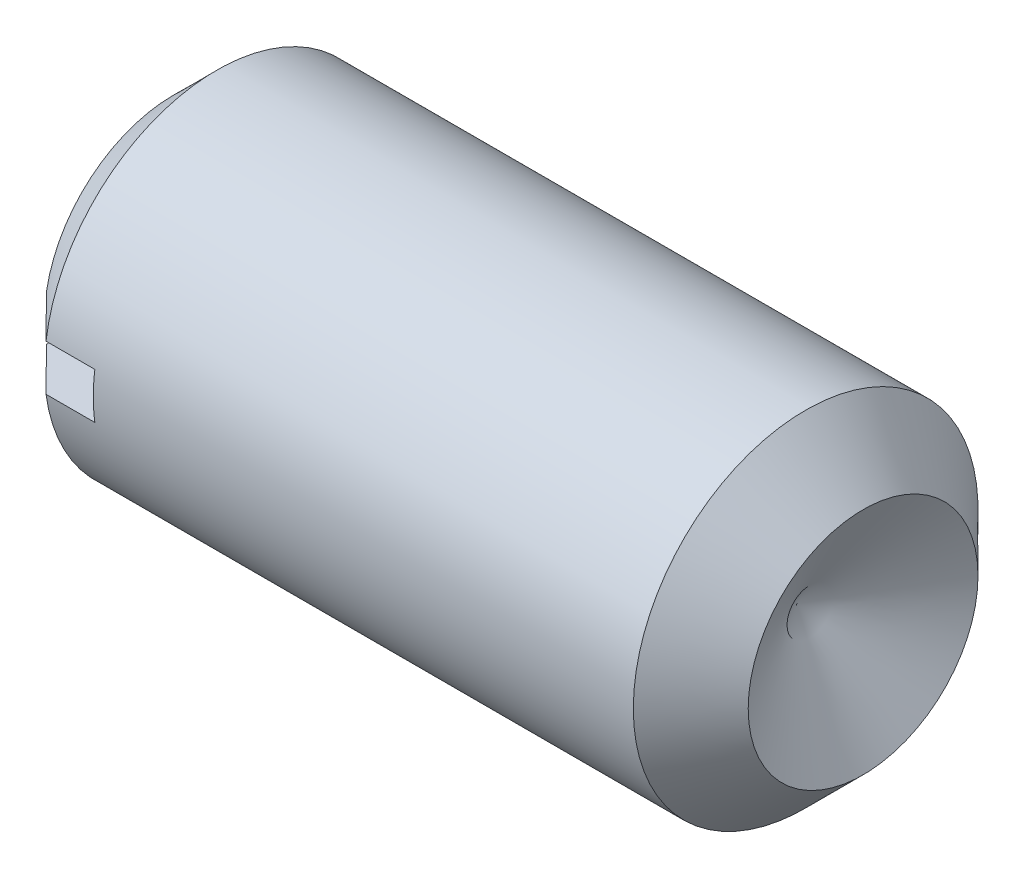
ISO-10303-21;
HEADER;
FILE_DESCRIPTION(('STEP AP214'),'2;1');
FILE_NAME('part.step','',(''),(''),'','','');
FILE_SCHEMA(('AUTOMOTIVE_DESIGN { 1 0 10303 214 1 1 1 1 }'));
ENDSEC;
DATA;
#1=APPLICATION_CONTEXT('core data for automotive mechanical design processes');
#2=APPLICATION_PROTOCOL_DEFINITION('international standard','automotive_design',2000,#1);
#3=PRODUCT_CONTEXT('',#1,'mechanical');
#4=PRODUCT('Part','Part','',(#3));
#5=PRODUCT_RELATED_PRODUCT_CATEGORY('part','',(#4));
#6=PRODUCT_DEFINITION_FORMATION('','',#4);
#7=PRODUCT_DEFINITION_CONTEXT('part definition',#1,'design');
#8=PRODUCT_DEFINITION('design','',#6,#7);
#9=PRODUCT_DEFINITION_SHAPE('','',#8);
#10=(LENGTH_UNIT() NAMED_UNIT(*) SI_UNIT(.MILLI.,.METRE.));
#11=(NAMED_UNIT(*) PLANE_ANGLE_UNIT() SI_UNIT($,.RADIAN.));
#12=(NAMED_UNIT(*) SI_UNIT($,.STERADIAN.) SOLID_ANGLE_UNIT());
#13=UNCERTAINTY_MEASURE_WITH_UNIT(LENGTH_MEASURE(1.E-05),#10,'distance_accuracy_value','');
#14=(GEOMETRIC_REPRESENTATION_CONTEXT(3) GLOBAL_UNCERTAINTY_ASSIGNED_CONTEXT((#13)) GLOBAL_UNIT_ASSIGNED_CONTEXT((#10,
#11,#12)) REPRESENTATION_CONTEXT('',''));
#15=CARTESIAN_POINT('',(0.,0.,0.));
#16=DIRECTION('',(0.,0.,1.));
#17=DIRECTION('',(1.,0.,0.));
#18=AXIS2_PLACEMENT_3D('',#15,#16,#17);
#19=CARTESIAN_POINT('',(0.,1.125,0.));
#20=DIRECTION('',(1.,0.,0.));
#21=DIRECTION('',(0.,0.,-1.));
#22=AXIS2_PLACEMENT_3D('',#19,#20,#21);
#23=PLANE('',#22);
#24=CARTESIAN_POINT('',(0.,0.,0.));
#25=DIRECTION('',(-1.,0.,0.));
#26=DIRECTION('',(0.,0.,1.));
#27=AXIS2_PLACEMENT_3D('',#24,#25,#26);
#28=CIRCLE('',#27,1.125);
#29=CARTESIAN_POINT('',(0.,0.2,1.10707949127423));
#30=VERTEX_POINT('',#29);
#31=CARTESIAN_POINT('',(0.,0.2,-1.10707949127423));
#32=VERTEX_POINT('',#31);
#33=EDGE_CURVE('E126',#30,#32,#28,.T.);
#34=ORIENTED_EDGE('',*,*,#33,.T.);
#35=DIRECTION('',(0.,0.,1.));
#36=VECTOR('',#35,1.);
#37=CARTESIAN_POINT('',(0.,0.2,-1.5));
#38=LINE('',#37,#36);
#39=EDGE_CURVE('E112',#32,#30,#38,.T.);
#40=ORIENTED_EDGE('',*,*,#39,.T.);
#41=EDGE_LOOP('',(#34,#40));
#42=FACE_BOUND('',#41,.T.);
#43=ADVANCED_FACE('F43',(#42),#23,.F.);
#44=CARTESIAN_POINT('',(0.375000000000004,0.,0.));
#45=DIRECTION('',(1.,0.,0.));
#46=DIRECTION('',(0.,0.,-1.));
#47=AXIS2_PLACEMENT_3D('',#44,#45,#46);
#48=CONICAL_SURFACE('',#47,1.5,0.785398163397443);
#49=CARTESIAN_POINT('',(0.375000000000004,0.,0.));
#50=DIRECTION('',(-1.,0.,0.));
#51=DIRECTION('',(0.,0.,1.));
#52=AXIS2_PLACEMENT_3D('',#49,#50,#51);
#53=CIRCLE('',#52,1.5);
#54=CARTESIAN_POINT('',(0.375000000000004,0.2,1.48660687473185));
#55=VERTEX_POINT('',#54);
#56=CARTESIAN_POINT('',(0.375000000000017,0.2,-1.48660687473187));
#57=VERTEX_POINT('',#56);
#58=EDGE_CURVE('E135',#55,#57,#53,.T.);
#59=ORIENTED_EDGE('',*,*,#58,.T.);
#60=CARTESIAN_POINT('',(2.18920799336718,0.2,-3.30816786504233));
#61=CARTESIAN_POINT('',(2.07649366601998,0.2,-3.19524610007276));
#62=CARTESIAN_POINT('',(1.96378832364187,0.2,-3.08231535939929));
#63=CARTESIAN_POINT('',(1.73840550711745,0.2,-2.85642283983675));
#64=CARTESIAN_POINT('',(1.6257280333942,0.2,-2.74346106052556));
#65=CARTESIAN_POINT('',(1.40037767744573,0.2,-2.51746010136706));
#66=CARTESIAN_POINT('',(1.28770480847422,0.2,-2.40442090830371));
#67=CARTESIAN_POINT('',(1.06242244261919,0.2,-2.17828252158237));
#68=CARTESIAN_POINT('',(0.949812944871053,0.2,-2.06518332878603));
#69=CARTESIAN_POINT('',(0.72157858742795,0.2,-1.83575394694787));
#70=CARTESIAN_POINT('',(0.605956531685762,0.2,-1.71942096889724));
#71=CARTESIAN_POINT('',(0.374890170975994,0.2,-1.48656880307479));
#72=CARTESIAN_POINT('',(0.259445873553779,0.2,-1.3700496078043));
#73=CARTESIAN_POINT('',(0.0865825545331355,0.2,-1.19499523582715));
#74=CARTESIAN_POINT('',(0.0290178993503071,0.2,-1.13660389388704));
#75=CARTESIAN_POINT('',(-0.0859582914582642,0.2,-1.01966845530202));
#76=CARTESIAN_POINT('',(-0.143369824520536,0.2,-0.961124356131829));
#77=CARTESIAN_POINT('',(-0.257927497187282,0.2,-0.843786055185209));
#78=CARTESIAN_POINT('',(-0.315073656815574,0.2,-0.784991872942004));
#79=CARTESIAN_POINT('',(-0.428894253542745,0.2,-0.666949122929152));
#80=CARTESIAN_POINT('',(-0.485568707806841,0.2,-0.607700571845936));
#81=CARTESIAN_POINT('',(-0.556834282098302,0.2,-0.531827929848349));
#82=CARTESIAN_POINT('',(-0.571929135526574,0.2,-0.515678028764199));
#83=CARTESIAN_POINT('',(-0.602008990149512,0.2,-0.483276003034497));
#84=CARTESIAN_POINT('',(-0.616993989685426,0.2,-0.467023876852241));
#85=CARTESIAN_POINT('',(-0.661668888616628,0.2,-0.418156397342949));
#86=CARTESIAN_POINT('',(-0.691153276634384,0.2,-0.385351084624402));
#87=CARTESIAN_POINT('',(-0.738520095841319,0.2,-0.330870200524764));
#88=CARTESIAN_POINT('',(-0.756726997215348,0.2,-0.309479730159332));
#89=CARTESIAN_POINT('',(-0.792449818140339,0.2,-0.26597934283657));
#90=CARTESIAN_POINT('',(-0.809962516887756,0.2,-0.243866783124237));
#91=CARTESIAN_POINT('',(-0.8437679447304,0.2,-0.198329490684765));
#92=CARTESIAN_POINT('',(-0.860046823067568,0.2,-0.174893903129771));
#93=CARTESIAN_POINT('',(-0.882018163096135,0.2,-0.13831631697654));
#94=CARTESIAN_POINT('',(-0.888920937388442,0.2,-0.125916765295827));
#95=CARTESIAN_POINT('',(-0.901444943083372,0.2,-0.100497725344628));
#96=CARTESIAN_POINT('',(-0.907068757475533,0.2,-0.0874795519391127));
#97=CARTESIAN_POINT('',(-0.916365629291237,0.2,-0.0607035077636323));
#98=CARTESIAN_POINT('',(-0.920035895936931,0.2,-0.046944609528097));
#99=CARTESIAN_POINT('',(-0.924561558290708,0.2,-0.019019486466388));
#100=CARTESIAN_POINT('',(-0.925434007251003,0.2,-0.00485626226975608));
#101=CARTESIAN_POINT('',(-0.924139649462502,0.2,0.0233294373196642));
#102=CARTESIAN_POINT('',(-0.921970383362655,0.2,0.0373517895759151));
#103=CARTESIAN_POINT('',(-0.915181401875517,0.2,0.064842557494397));
#104=CARTESIAN_POINT('',(-0.910545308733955,0.2,0.0783066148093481));
#105=CARTESIAN_POINT('',(-0.898239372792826,0.2,0.107921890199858));
#106=CARTESIAN_POINT('',(-0.890094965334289,0.2,0.123867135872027));
#107=CARTESIAN_POINT('',(-0.872331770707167,0.2,0.154929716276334));
#108=CARTESIAN_POINT('',(-0.862709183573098,0.2,0.170044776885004));
#109=CARTESIAN_POINT('',(-0.842523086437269,0.2,0.199782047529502));
#110=CARTESIAN_POINT('',(-0.831953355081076,0.2,0.214399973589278));
#111=CARTESIAN_POINT('',(-0.810271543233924,0.2,0.24319218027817));
#112=CARTESIAN_POINT('',(-0.79916020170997,0.2,0.257367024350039));
#113=CARTESIAN_POINT('',(-0.761648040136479,0.2,0.303984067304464));
#114=CARTESIAN_POINT('',(-0.734462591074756,0.2,0.335790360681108));
#115=CARTESIAN_POINT('',(-0.679232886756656,0.2,0.398651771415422));
#116=CARTESIAN_POINT('',(-0.651188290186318,0.2,0.429706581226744));
#117=CARTESIAN_POINT('',(-0.594583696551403,0.2,0.491419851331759));
#118=CARTESIAN_POINT('',(-0.566023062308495,0.2,0.522077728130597));
#119=CARTESIAN_POINT('',(-0.508622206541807,0.2,0.583118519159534));
#120=CARTESIAN_POINT('',(-0.479782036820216,0.2,0.613501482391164));
#121=CARTESIAN_POINT('',(-0.393361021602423,0.2,0.704003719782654));
#122=CARTESIAN_POINT('',(-0.335513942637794,0.2,0.763868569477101));
#123=CARTESIAN_POINT('',(-0.219518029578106,0.2,0.883224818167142));
#124=CARTESIAN_POINT('',(-0.161369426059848,0.2,0.942716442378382));
#125=CARTESIAN_POINT('',(-0.00876825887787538,0.2,1.09833366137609));
#126=CARTESIAN_POINT('',(0.08584162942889,0.2,1.19430497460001));
#127=CARTESIAN_POINT('',(0.27529800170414,0.2,1.38601480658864));
#128=CARTESIAN_POINT('',(0.370144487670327,0.2,1.48175332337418));
#129=CARTESIAN_POINT('',(0.654937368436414,0.2,1.76883520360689));
#130=CARTESIAN_POINT('',(0.845078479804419,0.2,1.95998539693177));
#131=CARTESIAN_POINT('',(1.22752139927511,0.2,2.34406726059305));
#132=CARTESIAN_POINT('',(1.41982522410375,0.2,2.53699691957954));
#133=CARTESIAN_POINT('',(1.80448365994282,0.2,2.92267869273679));
#134=CARTESIAN_POINT('',(1.99683823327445,0.2,3.11543084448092));
#135=CARTESIAN_POINT('',(2.18920799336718,0.2,3.30816786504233));
#136=B_SPLINE_CURVE_WITH_KNOTS('',3,(#60,#61,#62,#63,#64,#65,#66,#67,#68,#69,#70,#71,#72,#73,
#74,#75,#76,#77,#78,#79,#80,#81,#82,#83,#84,#85,#86,#87,#88,#89,#90,#91,#92,#93,#94,#95,#96,#97,
#98,#99,#100,#101,#102,#103,#104,#105,#106,#107,#108,#109,#110,#111,#112,#113,#114,#115,#116,
#117,#118,#119,#120,#121,#122,#123,#124,#125,#126,#127,#128,#129,#130,#131,#132,#133,#134,#135),
.UNSPECIFIED.,.F.,.F.,(4,2,2,2,2,2,2,2,2,2,2,2,2,2,2,2,2,2,2,2,2,2,2,2,2,2,2,2,2,2,2,2,2,2,2,2,
2,4),(0.,0.478646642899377,0.957300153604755,1.43610836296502,1.91490987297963,2.40696308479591,
2.89903663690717,3.14502260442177,3.39101266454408,3.63698385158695,3.88294604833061,
3.94926343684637,4.01558182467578,4.14789298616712,4.23214940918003,4.31675946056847,
4.40221020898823,4.444739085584,4.48718129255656,4.52968396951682,4.57192708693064,
4.61420437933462,4.6567659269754,4.71033863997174,4.76405145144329,4.81814735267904,
4.87217140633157,4.99764955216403,5.12317821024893,5.24887419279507,5.37454731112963,
5.62428482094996,5.87385340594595,6.27814619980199,6.68244241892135,7.49128561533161,
8.30849034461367,9.12542549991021),.UNSPECIFIED.);
#137=EDGE_CURVE('E189',#57,#32,#136,.T.);
#138=ORIENTED_EDGE('',*,*,#137,.T.);
#139=ORIENTED_EDGE('',*,*,#33,.F.);
#140=EDGE_CURVE('E146',#30,#55,#136,.T.);
#141=ORIENTED_EDGE('',*,*,#140,.T.);
#142=EDGE_LOOP('',(#59,#138,#139,#141));
#143=FACE_BOUND('',#142,.T.);
#144=ADVANCED_FACE('F170',(#143),#48,.T.);
#145=CARTESIAN_POINT('',(0.,-0.2,-1.10707949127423));
#146=VERTEX_POINT('',#145);
#147=CARTESIAN_POINT('',(0.,-0.2,1.10707949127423));
#148=VERTEX_POINT('',#147);
#149=EDGE_CURVE('E129',#146,#148,#28,.T.);
#150=ORIENTED_EDGE('',*,*,#149,.T.);
#151=DIRECTION('',(0.,0.,1.));
#152=VECTOR('',#151,1.);
#153=CARTESIAN_POINT('',(0.,-0.2,-1.5));
#154=LINE('',#153,#152);
#155=EDGE_CURVE('E110',#146,#148,#154,.T.);
#156=ORIENTED_EDGE('',*,*,#155,.F.);
#157=EDGE_LOOP('',(#150,#156));
#158=FACE_BOUND('',#157,.T.);
#159=ADVANCED_FACE('F44',(#158),#23,.F.);
#160=CARTESIAN_POINT('',(5.42264973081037,0.,0.));
#161=DIRECTION('',(1.,0.,0.));
#162=DIRECTION('',(0.,0.,-1.));
#163=AXIS2_PLACEMENT_3D('',#160,#161,#162);
#164=CONICAL_SURFACE('',#163,0.,1.04719755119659);
#165=CARTESIAN_POINT('',(6.,0.,0.));
#166=DIRECTION('',(-1.,0.,0.));
#167=DIRECTION('',(0.,0.,1.));
#168=AXIS2_PLACEMENT_3D('',#165,#166,#167);
#169=CIRCLE('',#168,1.);
#170=CARTESIAN_POINT('',(6.,0.,1.));
#171=VERTEX_POINT('',#170);
#172=EDGE_CURVE('E136',#171,#171,#169,.T.);
#173=ORIENTED_EDGE('',*,*,#172,.F.);
#174=EDGE_LOOP('',(#173));
#175=FACE_BOUND('',#174,.T.);
#176=CARTESIAN_POINT('',(5.42264973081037,0.,0.));
#177=VERTEX_POINT('',#176);
#178=VERTEX_LOOP('',#177);
#179=FACE_BOUND('',#178,.T.);
#180=ADVANCED_FACE('F172',(#175,#179),#164,.F.);
#181=CARTESIAN_POINT('',(6.,0.,0.));
#182=DIRECTION('',(-1.,0.,0.));
#183=DIRECTION('',(0.,0.,1.));
#184=AXIS2_PLACEMENT_3D('',#181,#182,#183);
#185=CONICAL_SURFACE('',#184,1.,0.785398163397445);
#186=CARTESIAN_POINT('',(5.5,0.,0.));
#187=DIRECTION('',(-1.,0.,0.));
#188=DIRECTION('',(0.,0.,1.));
#189=AXIS2_PLACEMENT_3D('',#186,#187,#188);
#190=CIRCLE('',#189,1.5);
#191=CARTESIAN_POINT('',(5.5,0.,1.5));
#192=VERTEX_POINT('',#191);
#193=EDGE_CURVE('E133',#192,#192,#190,.T.);
#194=ORIENTED_EDGE('',*,*,#193,.F.);
#195=EDGE_LOOP('',(#194));
#196=FACE_BOUND('',#195,.T.);
#197=ORIENTED_EDGE('',*,*,#172,.T.);
#198=EDGE_LOOP('',(#197));
#199=FACE_BOUND('',#198,.T.);
#200=ADVANCED_FACE('F179',(#196,#199),#185,.T.);
#201=CARTESIAN_POINT('',(-10.7450145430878,0.,0.));
#202=DIRECTION('',(-1.,0.,0.));
#203=DIRECTION('',(0.,0.,1.));
#204=AXIS2_PLACEMENT_3D('',#201,#202,#203);
#205=CYLINDRICAL_SURFACE('',#204,1.5);
#206=CARTESIAN_POINT('',(0.8,0.,0.));
#207=DIRECTION('',(1.,0.,0.));
#208=DIRECTION('',(0.,0.,-1.));
#209=AXIS2_PLACEMENT_3D('',#206,#207,#208);
#210=CIRCLE('',#209,1.5);
#211=CARTESIAN_POINT('',(0.8,-0.2,-1.48660687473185));
#212=VERTEX_POINT('',#211);
#213=CARTESIAN_POINT('',(0.8,0.2,-1.48660687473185));
#214=VERTEX_POINT('',#213);
#215=EDGE_CURVE('E11',#212,#214,#210,.T.);
#216=ORIENTED_EDGE('',*,*,#215,.T.);
#217=DIRECTION('',(-1.,0.,0.));
#218=VECTOR('',#217,1.);
#219=CARTESIAN_POINT('',(-10.7450145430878,0.2,-1.48660687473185));
#220=LINE('',#219,#218);
#221=EDGE_CURVE('E121',#214,#57,#220,.T.);
#222=ORIENTED_EDGE('',*,*,#221,.T.);
#223=ORIENTED_EDGE('',*,*,#58,.F.);
#224=DIRECTION('',(-1.,0.,0.));
#225=VECTOR('',#224,1.);
#226=CARTESIAN_POINT('',(-10.7450145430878,0.2,1.48660687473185));
#227=LINE('',#226,#225);
#228=CARTESIAN_POINT('',(0.8,0.2,1.48660687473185));
#229=VERTEX_POINT('',#228);
#230=EDGE_CURVE('E116',#55,#229,#227,.F.);
#231=ORIENTED_EDGE('',*,*,#230,.T.);
#232=CARTESIAN_POINT('',(0.8,-0.2,1.48660687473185));
#233=VERTEX_POINT('',#232);
#234=EDGE_CURVE('E50',#229,#233,#210,.T.);
#235=ORIENTED_EDGE('',*,*,#234,.T.);
#236=DIRECTION('',(-1.,0.,0.));
#237=VECTOR('',#236,1.);
#238=CARTESIAN_POINT('',(-10.7450145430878,-0.2,1.48660687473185));
#239=LINE('',#238,#237);
#240=CARTESIAN_POINT('',(0.375000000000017,-0.2,1.48660687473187));
#241=VERTEX_POINT('',#240);
#242=EDGE_CURVE('E106',#233,#241,#239,.T.);
#243=ORIENTED_EDGE('',*,*,#242,.T.);
#244=CARTESIAN_POINT('',(0.375000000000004,-0.2,-1.48660687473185));
#245=VERTEX_POINT('',#244);
#246=EDGE_CURVE('E113',#245,#241,#53,.T.);
#247=ORIENTED_EDGE('',*,*,#246,.F.);
#248=DIRECTION('',(-1.,0.,0.));
#249=VECTOR('',#248,1.);
#250=CARTESIAN_POINT('',(-10.7450145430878,-0.2,-1.48660687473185));
#251=LINE('',#250,#249);
#252=EDGE_CURVE('E59',#245,#212,#251,.F.);
#253=ORIENTED_EDGE('',*,*,#252,.T.);
#254=EDGE_LOOP('',(#216,#222,#223,#231,#235,#243,#247,#253));
#255=FACE_BOUND('',#254,.T.);
#256=ORIENTED_EDGE('',*,*,#193,.T.);
#257=EDGE_LOOP('',(#256));
#258=FACE_BOUND('',#257,.T.);
#259=ADVANCED_FACE('F109',(#255,#258),#205,.T.);
#260=ORIENTED_EDGE('',*,*,#246,.T.);
#261=CARTESIAN_POINT('',(2.18920799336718,-0.2,3.30816786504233));
#262=CARTESIAN_POINT('',(2.07649366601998,-0.2,3.19524610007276));
#263=CARTESIAN_POINT('',(1.96378832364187,-0.2,3.08231535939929));
#264=CARTESIAN_POINT('',(1.73840550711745,-0.2,2.85642283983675));
#265=CARTESIAN_POINT('',(1.6257280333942,-0.2,2.74346106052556));
#266=CARTESIAN_POINT('',(1.40037767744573,-0.2,2.51746010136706));
#267=CARTESIAN_POINT('',(1.28770480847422,-0.2,2.40442090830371));
#268=CARTESIAN_POINT('',(1.06242244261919,-0.2,2.17828252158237));
#269=CARTESIAN_POINT('',(0.949812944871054,-0.2,2.06518332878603));
#270=CARTESIAN_POINT('',(0.721578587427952,-0.2,1.83575394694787));
#271=CARTESIAN_POINT('',(0.605956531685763,-0.2,1.71942096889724));
#272=CARTESIAN_POINT('',(0.374890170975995,-0.2,1.48656880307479));
#273=CARTESIAN_POINT('',(0.25944587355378,-0.2,1.3700496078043));
#274=CARTESIAN_POINT('',(0.0865825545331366,-0.2,1.19499523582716));
#275=CARTESIAN_POINT('',(0.0290178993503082,-0.2,1.13660389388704));
#276=CARTESIAN_POINT('',(-0.0859582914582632,-0.2,1.01966845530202));
#277=CARTESIAN_POINT('',(-0.143369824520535,-0.2,0.96112435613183));
#278=CARTESIAN_POINT('',(-0.257927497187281,-0.2,0.843786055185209));
#279=CARTESIAN_POINT('',(-0.315073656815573,-0.2,0.784991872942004));
#280=CARTESIAN_POINT('',(-0.428894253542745,-0.2,0.666949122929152));
#281=CARTESIAN_POINT('',(-0.485568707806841,-0.2,0.607700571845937));
#282=CARTESIAN_POINT('',(-0.556834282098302,-0.2,0.53182792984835));
#283=CARTESIAN_POINT('',(-0.571929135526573,-0.2,0.515678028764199));
#284=CARTESIAN_POINT('',(-0.602008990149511,-0.2,0.483276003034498));
#285=CARTESIAN_POINT('',(-0.616993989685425,-0.2,0.467023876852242));
#286=CARTESIAN_POINT('',(-0.661668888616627,-0.2,0.418156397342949));
#287=CARTESIAN_POINT('',(-0.691153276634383,-0.2,0.385351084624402));
#288=CARTESIAN_POINT('',(-0.738520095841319,-0.2,0.330870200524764));
#289=CARTESIAN_POINT('',(-0.756726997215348,-0.2,0.309479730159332));
#290=CARTESIAN_POINT('',(-0.792449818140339,-0.2,0.26597934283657));
#291=CARTESIAN_POINT('',(-0.809962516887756,-0.2,0.243866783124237));
#292=CARTESIAN_POINT('',(-0.8437679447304,-0.2,0.198329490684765));
#293=CARTESIAN_POINT('',(-0.860046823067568,-0.2,0.174893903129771));
#294=CARTESIAN_POINT('',(-0.882018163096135,-0.2,0.138316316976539));
#295=CARTESIAN_POINT('',(-0.888920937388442,-0.2,0.125916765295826));
#296=CARTESIAN_POINT('',(-0.901444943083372,-0.2,0.100497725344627));
#297=CARTESIAN_POINT('',(-0.907068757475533,-0.2,0.0874795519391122));
#298=CARTESIAN_POINT('',(-0.916365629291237,-0.2,0.0607035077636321));
#299=CARTESIAN_POINT('',(-0.920035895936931,-0.2,0.0469446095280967));
#300=CARTESIAN_POINT('',(-0.924561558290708,-0.2,0.0190194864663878));
#301=CARTESIAN_POINT('',(-0.925434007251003,-0.2,0.00485626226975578));
#302=CARTESIAN_POINT('',(-0.924139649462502,-0.2,-0.0233294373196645));
#303=CARTESIAN_POINT('',(-0.921970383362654,-0.2,-0.0373517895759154));
#304=CARTESIAN_POINT('',(-0.915181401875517,-0.2,-0.0648425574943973));
#305=CARTESIAN_POINT('',(-0.910545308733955,-0.2,-0.0783066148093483));
#306=CARTESIAN_POINT('',(-0.898239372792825,-0.2,-0.107921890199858));
#307=CARTESIAN_POINT('',(-0.890094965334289,-0.2,-0.123867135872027));
#308=CARTESIAN_POINT('',(-0.872331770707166,-0.2,-0.154929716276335));
#309=CARTESIAN_POINT('',(-0.862709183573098,-0.2,-0.170044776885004));
#310=CARTESIAN_POINT('',(-0.842523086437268,-0.2,-0.199782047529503));
#311=CARTESIAN_POINT('',(-0.831953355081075,-0.2,-0.214399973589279));
#312=CARTESIAN_POINT('',(-0.810271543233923,-0.2,-0.243192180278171));
#313=CARTESIAN_POINT('',(-0.799160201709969,-0.2,-0.25736702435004));
#314=CARTESIAN_POINT('',(-0.761648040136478,-0.2,-0.303984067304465));
#315=CARTESIAN_POINT('',(-0.734462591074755,-0.2,-0.335790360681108));
#316=CARTESIAN_POINT('',(-0.679232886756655,-0.2,-0.398651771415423));
#317=CARTESIAN_POINT('',(-0.651188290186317,-0.2,-0.429706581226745));
#318=CARTESIAN_POINT('',(-0.594583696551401,-0.2,-0.491419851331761));
#319=CARTESIAN_POINT('',(-0.566023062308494,-0.2,-0.522077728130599));
#320=CARTESIAN_POINT('',(-0.508622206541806,-0.2,-0.583118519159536));
#321=CARTESIAN_POINT('',(-0.479782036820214,-0.2,-0.613501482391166));
#322=CARTESIAN_POINT('',(-0.39336102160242,-0.2,-0.704003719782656));
#323=CARTESIAN_POINT('',(-0.335513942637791,-0.2,-0.763868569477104));
#324=CARTESIAN_POINT('',(-0.219518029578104,-0.2,-0.883224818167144));
#325=CARTESIAN_POINT('',(-0.161369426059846,-0.2,-0.942716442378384));
#326=CARTESIAN_POINT('',(-0.00876825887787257,-0.2,-1.0983336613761));
#327=CARTESIAN_POINT('',(0.0858416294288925,-0.2,-1.19430497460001));
#328=CARTESIAN_POINT('',(0.275298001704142,-0.2,-1.38601480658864));
#329=CARTESIAN_POINT('',(0.37014448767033,-0.2,-1.48175332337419));
#330=CARTESIAN_POINT('',(0.654937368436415,-0.2,-1.76883520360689));
#331=CARTESIAN_POINT('',(0.84507847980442,-0.2,-1.95998539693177));
#332=CARTESIAN_POINT('',(1.22752139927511,-0.2,-2.34406726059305));
#333=CARTESIAN_POINT('',(1.41982522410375,-0.2,-2.53699691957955));
#334=CARTESIAN_POINT('',(1.80448365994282,-0.2,-2.92267869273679));
#335=CARTESIAN_POINT('',(1.99683823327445,-0.2,-3.11543084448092));
#336=CARTESIAN_POINT('',(2.18920799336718,-0.2,-3.30816786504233));
#337=B_SPLINE_CURVE_WITH_KNOTS('',3,(#261,#262,#263,#264,#265,#266,#267,#268,#269,#270,#271,
#272,#273,#274,#275,#276,#277,#278,#279,#280,#281,#282,#283,#284,#285,#286,#287,#288,#289,#290,
#291,#292,#293,#294,#295,#296,#297,#298,#299,#300,#301,#302,#303,#304,#305,#306,#307,#308,#309,
#310,#311,#312,#313,#314,#315,#316,#317,#318,#319,#320,#321,#322,#323,#324,#325,#326,#327,#328,
#329,#330,#331,#332,#333,#334,#335,#336),.UNSPECIFIED.,.F.,.F.,(4,2,2,2,2,2,2,2,2,2,2,2,2,2,2,2,
2,2,2,2,2,2,2,2,2,2,2,2,2,2,2,2,2,2,2,2,2,4),(0.,0.478646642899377,0.957300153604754,
1.43610836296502,1.91490987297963,2.40696308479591,2.89903663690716,3.14502260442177,
3.39101266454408,3.63698385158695,3.88294604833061,3.94926343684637,4.01558182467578,
4.14789298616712,4.23214940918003,4.31675946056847,4.40221020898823,4.444739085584,
4.48718129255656,4.52968396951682,4.57192708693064,4.61420437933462,4.6567659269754,
4.71033863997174,4.76405145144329,4.81814735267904,4.87217140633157,4.99764955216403,
5.12317821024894,5.24887419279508,5.37454731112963,5.62428482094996,5.87385340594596,
6.278146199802,6.68244241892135,7.49128561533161,8.30849034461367,9.12542549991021),.UNSPECIFIED.);
#338=EDGE_CURVE('E149',#241,#148,#337,.T.);
#339=ORIENTED_EDGE('',*,*,#338,.T.);
#340=ORIENTED_EDGE('',*,*,#149,.F.);
#341=EDGE_CURVE('E137',#146,#245,#337,.T.);
#342=ORIENTED_EDGE('',*,*,#341,.T.);
#343=EDGE_LOOP('',(#260,#339,#340,#342));
#344=FACE_BOUND('',#343,.T.);
#345=ADVANCED_FACE('F153',(#344),#48,.T.);
#346=CARTESIAN_POINT('',(0.8,0.2,-1.5));
#347=DIRECTION('',(1.,0.,0.));
#348=DIRECTION('',(0.,0.,-1.));
#349=AXIS2_PLACEMENT_3D('',#346,#347,#348);
#350=PLANE('',#349);
#351=DIRECTION('',(0.,0.,1.));
#352=VECTOR('',#351,1.);
#353=CARTESIAN_POINT('',(0.8,0.2,-1.5));
#354=LINE('',#353,#352);
#355=EDGE_CURVE('E99',#214,#229,#354,.T.);
#356=ORIENTED_EDGE('',*,*,#355,.F.);
#357=ORIENTED_EDGE('',*,*,#215,.F.);
#358=DIRECTION('',(0.,0.,1.));
#359=VECTOR('',#358,1.);
#360=CARTESIAN_POINT('',(0.8,-0.2,-1.5));
#361=LINE('',#360,#359);
#362=EDGE_CURVE('E97',#212,#233,#361,.T.);
#363=ORIENTED_EDGE('',*,*,#362,.T.);
#364=ORIENTED_EDGE('',*,*,#234,.F.);
#365=EDGE_LOOP('',(#356,#357,#363,#364));
#366=FACE_BOUND('',#365,.T.);
#367=ADVANCED_FACE('F98',(#366),#350,.F.);
#368=CARTESIAN_POINT('',(0.,0.2,-1.5));
#369=DIRECTION('',(0.,1.,0.));
#370=DIRECTION('',(0.,0.,1.));
#371=AXIS2_PLACEMENT_3D('',#368,#369,#370);
#372=PLANE('',#371);
#373=ORIENTED_EDGE('',*,*,#355,.T.);
#374=ORIENTED_EDGE('',*,*,#230,.F.);
#375=ORIENTED_EDGE('',*,*,#140,.F.);
#376=ORIENTED_EDGE('',*,*,#39,.F.);
#377=ORIENTED_EDGE('',*,*,#137,.F.);
#378=ORIENTED_EDGE('',*,*,#221,.F.);
#379=EDGE_LOOP('',(#373,#374,#375,#376,#377,#378));
#380=FACE_BOUND('',#379,.T.);
#381=ADVANCED_FACE('F157',(#380),#372,.F.);
#382=CARTESIAN_POINT('',(0.,-0.2,-1.5));
#383=DIRECTION('',(0.,-1.,0.));
#384=DIRECTION('',(1.,0.,0.));
#385=AXIS2_PLACEMENT_3D('',#382,#383,#384);
#386=PLANE('',#385);
#387=ORIENTED_EDGE('',*,*,#362,.F.);
#388=ORIENTED_EDGE('',*,*,#252,.F.);
#389=ORIENTED_EDGE('',*,*,#341,.F.);
#390=ORIENTED_EDGE('',*,*,#155,.T.);
#391=ORIENTED_EDGE('',*,*,#338,.F.);
#392=ORIENTED_EDGE('',*,*,#242,.F.);
#393=EDGE_LOOP('',(#387,#388,#389,#390,#391,#392));
#394=FACE_BOUND('',#393,.T.);
#395=ADVANCED_FACE('F104',(#394),#386,.F.);
#396=CLOSED_SHELL('',(#43,#144,#159,#180,#200,#259,#345,#367,#381,#395));
#397=MANIFOLD_SOLID_BREP('B2',#396);
#398=ADVANCED_BREP_SHAPE_REPRESENTATION('',(#18,#397),#14);
#399=SHAPE_DEFINITION_REPRESENTATION(#9,#398);
ENDSEC;
END-ISO-10303-21;
